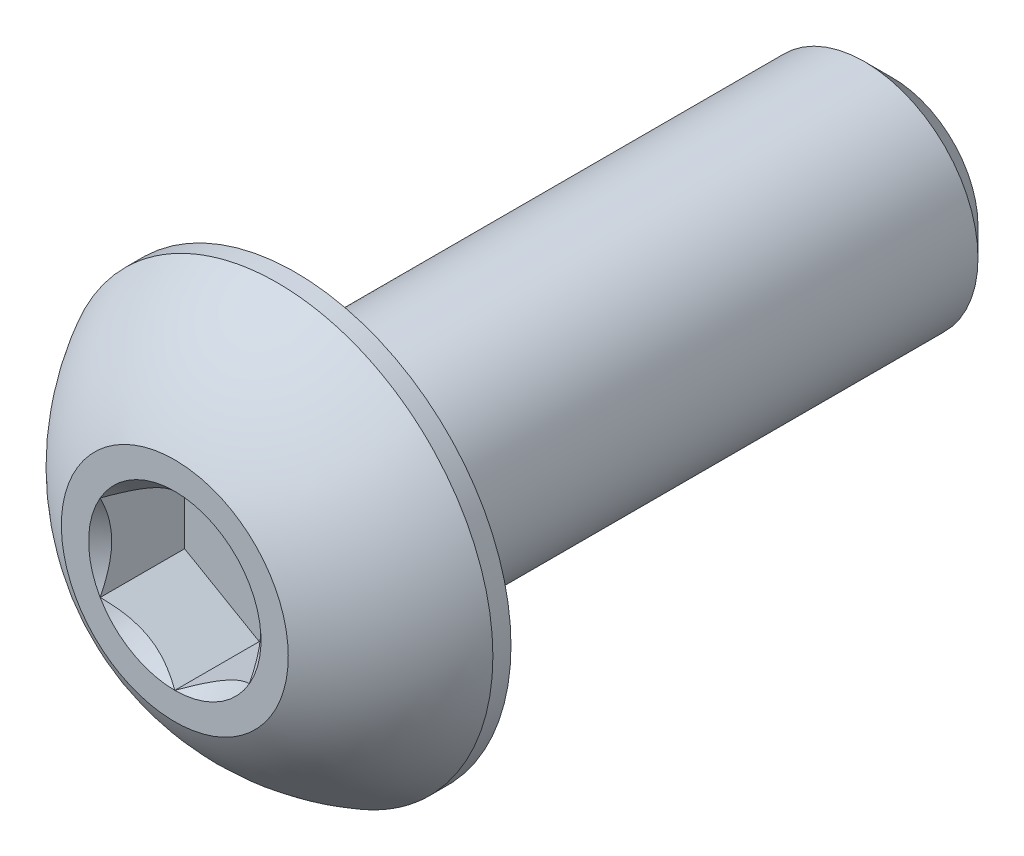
ISO-10303-21;
HEADER;
FILE_DESCRIPTION(('STEP AP214'),'2;1');
FILE_NAME('part.step','',(''),(''),'','','');
FILE_SCHEMA(('AUTOMOTIVE_DESIGN { 1 0 10303 214 1 1 1 1 }'));
ENDSEC;
DATA;
#1=APPLICATION_CONTEXT('core data for automotive mechanical design processes');
#2=APPLICATION_PROTOCOL_DEFINITION('international standard','automotive_design',2000,#1);
#3=PRODUCT_CONTEXT('',#1,'mechanical');
#4=PRODUCT('Part','Part','',(#3));
#5=PRODUCT_RELATED_PRODUCT_CATEGORY('part','',(#4));
#6=PRODUCT_DEFINITION_FORMATION('','',#4);
#7=PRODUCT_DEFINITION_CONTEXT('part definition',#1,'design');
#8=PRODUCT_DEFINITION('design','',#6,#7);
#9=PRODUCT_DEFINITION_SHAPE('','',#8);
#10=(LENGTH_UNIT() NAMED_UNIT(*) SI_UNIT(.MILLI.,.METRE.));
#11=(NAMED_UNIT(*) PLANE_ANGLE_UNIT() SI_UNIT($,.RADIAN.));
#12=(NAMED_UNIT(*) SI_UNIT($,.STERADIAN.) SOLID_ANGLE_UNIT());
#13=UNCERTAINTY_MEASURE_WITH_UNIT(LENGTH_MEASURE(1.E-05),#10,'distance_accuracy_value','');
#14=(GEOMETRIC_REPRESENTATION_CONTEXT(3) GLOBAL_UNCERTAINTY_ASSIGNED_CONTEXT((#13)) GLOBAL_UNIT_ASSIGNED_CONTEXT((#10,
#11,#12)) REPRESENTATION_CONTEXT('',''));
#15=CARTESIAN_POINT('',(0.,0.,0.));
#16=DIRECTION('',(0.,0.,1.));
#17=DIRECTION('',(1.,0.,0.));
#18=AXIS2_PLACEMENT_3D('',#15,#16,#17);
#19=CARTESIAN_POINT('',(1.5875,-0.91654355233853,-1.79578));
#20=DIRECTION('',(1.,0.,0.));
#21=DIRECTION('',(0.,0.,-1.));
#22=AXIS2_PLACEMENT_3D('',#19,#20,#21);
#23=PLANE('',#22);
#24=CARTESIAN_POINT('',(1.5875,0.916543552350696,-4.5148160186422E-11));
#25=CARTESIAN_POINT('',(1.5875,0.853951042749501,-0.0312670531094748));
#26=CARTESIAN_POINT('',(1.5875,0.790318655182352,-0.0607084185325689));
#27=CARTESIAN_POINT('',(1.5875,0.660541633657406,-0.114675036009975));
#28=CARTESIAN_POINT('',(1.5875,0.594383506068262,-0.139167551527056));
#29=CARTESIAN_POINT('',(1.5875,0.460155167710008,-0.181460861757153));
#30=CARTESIAN_POINT('',(1.5875,0.392092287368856,-0.199284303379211));
#31=CARTESIAN_POINT('',(1.5875,0.25447447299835,-0.226724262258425));
#32=CARTESIAN_POINT('',(1.5875,0.184924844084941,-0.23636615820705));
#33=CARTESIAN_POINT('',(1.5875,0.0959348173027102,-0.242807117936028));
#34=CARTESIAN_POINT('',(1.5875,0.0767574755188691,-0.243848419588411));
#35=CARTESIAN_POINT('',(1.5875,0.0383876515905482,-0.245238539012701));
#36=CARTESIAN_POINT('',(1.5875,0.0191951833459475,-0.245587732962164));
#37=CARTESIAN_POINT('',(1.5875,-0.04817613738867,-0.245585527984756));
#38=CARTESIAN_POINT('',(1.5875,-0.0963693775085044,-0.243380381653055));
#39=CARTESIAN_POINT('',(1.5875,-0.19237997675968,-0.234690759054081));
#40=CARTESIAN_POINT('',(1.5875,-0.240197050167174,-0.22820329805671));
#41=CARTESIAN_POINT('',(1.5875,-0.383011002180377,-0.202723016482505));
#42=CARTESIAN_POINT('',(1.5875,-0.476967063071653,-0.177716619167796));
#43=CARTESIAN_POINT('',(1.5875,-0.628737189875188,-0.12655997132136));
#44=CARTESIAN_POINT('',(1.5875,-0.687787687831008,-0.103812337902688));
#45=CARTESIAN_POINT('',(1.5875,-0.80365276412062,-0.0545108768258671));
#46=CARTESIAN_POINT('',(1.5875,-0.860482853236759,-0.0279937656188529));
#47=CARTESIAN_POINT('',(1.5875,-0.916543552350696,-4.51483131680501E-11));
#48=B_SPLINE_CURVE_WITH_KNOTS('',3,(#24,#25,#26,#27,#28,#29,#30,#31,#32,#33,#34,#35,#36,#37,#38,
#39,#40,#41,#42,#43,#44,#45,#46,#47),.UNSPECIFIED.,.F.,.F.,(4,2,2,2,2,2,2,2,2,2,2,4),(0.,
0.210047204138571,0.421441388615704,0.632111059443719,0.842124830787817,0.899732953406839,
0.957309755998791,1.10181621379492,1.246423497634,1.53683268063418,1.72655304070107,
1.91453812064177),.UNSPECIFIED.);
#49=CARTESIAN_POINT('',(1.58750000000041,0.916543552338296,-5.09958482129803E-11));
#50=VERTEX_POINT('',#49);
#51=CARTESIAN_POINT('',(1.58750000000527,-0.916543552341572,-4.51486722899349E-11));
#52=VERTEX_POINT('',#51);
#53=EDGE_CURVE('E20',#50,#52,#48,.T.);
#54=ORIENTED_EDGE('',*,*,#53,.F.);
#55=DIRECTION('',(0.,0.,1.));
#56=VECTOR('',#55,1.);
#57=CARTESIAN_POINT('',(1.5875,0.916543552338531,-1.79578));
#58=LINE('',#57,#56);
#59=CARTESIAN_POINT('',(1.5875,0.916543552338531,-1.79578));
#60=VERTEX_POINT('',#59);
#61=EDGE_CURVE('E68',#50,#60,#58,.F.);
#62=ORIENTED_EDGE('',*,*,#61,.T.);
#63=DIRECTION('',(0.,1.,0.));
#64=VECTOR('',#63,1.);
#65=CARTESIAN_POINT('',(1.5875,-0.91654355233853,-1.79578));
#66=LINE('',#65,#64);
#67=CARTESIAN_POINT('',(1.5875,-0.91654355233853,-1.79578));
#68=VERTEX_POINT('',#67);
#69=EDGE_CURVE('E74',#68,#60,#66,.T.);
#70=ORIENTED_EDGE('',*,*,#69,.F.);
#71=DIRECTION('',(0.,0.,1.));
#72=VECTOR('',#71,1.);
#73=CARTESIAN_POINT('',(1.5875,-0.91654355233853,-1.79578));
#74=LINE('',#73,#72);
#75=EDGE_CURVE('E71',#68,#52,#74,.T.);
#76=ORIENTED_EDGE('',*,*,#75,.T.);
#77=EDGE_LOOP('',(#54,#62,#70,#76));
#78=FACE_BOUND('',#77,.T.);
#79=ADVANCED_FACE('F16',(#78),#23,.F.);
#80=CARTESIAN_POINT('',(1.5875,-0.91654355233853,-1.79578));
#81=DIRECTION('',(0.,0.,1.));
#82=DIRECTION('',(1.,0.,0.));
#83=AXIS2_PLACEMENT_3D('',#80,#81,#82);
#84=PLANE('',#83);
#85=DIRECTION('',(0.,-1.,0.));
#86=VECTOR('',#85,1.);
#87=CARTESIAN_POINT('',(-1.5875,0.916543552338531,-1.79578));
#88=LINE('',#87,#86);
#89=CARTESIAN_POINT('',(-1.5875,0.91654355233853,-1.79578));
#90=VERTEX_POINT('',#89);
#91=CARTESIAN_POINT('',(-1.5875,-0.916543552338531,-1.79578));
#92=VERTEX_POINT('',#91);
#93=EDGE_CURVE('E217',#90,#92,#88,.T.);
#94=ORIENTED_EDGE('',*,*,#93,.T.);
#95=DIRECTION('',(0.866025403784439,-0.5,0.));
#96=VECTOR('',#95,1.);
#97=CARTESIAN_POINT('',(-1.5875,-0.916543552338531,-1.79578));
#98=LINE('',#97,#96);
#99=CARTESIAN_POINT('',(0.,-1.83308710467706,-1.79578));
#100=VERTEX_POINT('',#99);
#101=EDGE_CURVE('E243',#92,#100,#98,.T.);
#102=ORIENTED_EDGE('',*,*,#101,.T.);
#103=DIRECTION('',(0.866025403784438,0.5,0.));
#104=VECTOR('',#103,1.);
#105=CARTESIAN_POINT('',(0.,-1.83308710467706,-1.79578));
#106=LINE('',#105,#104);
#107=EDGE_CURVE('E232',#100,#68,#106,.T.);
#108=ORIENTED_EDGE('',*,*,#107,.T.);
#109=ORIENTED_EDGE('',*,*,#69,.T.);
#110=DIRECTION('',(-0.866025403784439,0.5,0.));
#111=VECTOR('',#110,1.);
#112=CARTESIAN_POINT('',(1.5875,0.916543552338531,-1.79578));
#113=LINE('',#112,#111);
#114=CARTESIAN_POINT('',(0.,1.83308710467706,-1.79578));
#115=VERTEX_POINT('',#114);
#116=EDGE_CURVE('E81',#60,#115,#113,.T.);
#117=ORIENTED_EDGE('',*,*,#116,.T.);
#118=DIRECTION('',(-0.866025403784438,-0.5,0.));
#119=VECTOR('',#118,1.);
#120=CARTESIAN_POINT('',(0.,1.83308710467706,-1.79578));
#121=LINE('',#120,#119);
#122=EDGE_CURVE('E82',#115,#90,#121,.T.);
#123=ORIENTED_EDGE('',*,*,#122,.T.);
#124=EDGE_LOOP('',(#94,#102,#108,#109,#117,#123));
#125=FACE_BOUND('',#124,.T.);
#126=ADVANCED_FACE('F161',(#125),#84,.T.);
#127=CARTESIAN_POINT('',(-1.5875,-0.916543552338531,-1.79578));
#128=DIRECTION('',(-0.5,-0.866025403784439,0.));
#129=DIRECTION('',(0.866025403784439,-0.5,0.));
#130=AXIS2_PLACEMENT_3D('',#127,#128,#129);
#131=PLANE('',#130);
#132=CARTESIAN_POINT('',(-1.58750000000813,-0.916543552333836,-4.65365177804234E-11));
#133=CARTESIAN_POINT('',(-1.53293684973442,-0.948045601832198,-0.0314718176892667));
#134=CARTESIAN_POINT('',(-1.47746140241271,-0.980074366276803,-0.0610949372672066));
#135=CARTESIAN_POINT('',(-1.36434127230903,-1.04538430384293,-0.115333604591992));
#136=CARTESIAN_POINT('',(-1.30668583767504,-1.07867168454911,-0.139918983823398));
#137=CARTESIAN_POINT('',(-1.1904264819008,-1.14579405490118,-0.18203390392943));
#138=CARTESIAN_POINT('',(-1.13185215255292,-1.17961195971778,-0.199669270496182));
#139=CARTESIAN_POINT('',(-1.01341433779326,-1.2479920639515,-0.226839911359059));
#140=CARTESIAN_POINT('',(-0.95355446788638,-1.28255217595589,-0.236395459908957));
#141=CARTESIAN_POINT('',(-0.850383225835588,-1.34211812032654,-0.245017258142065));
#142=CARTESIAN_POINT('',(-0.807205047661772,-1.36704705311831,-0.24629317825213));
#143=CARTESIAN_POINT('',(-0.720919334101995,-1.41686413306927,-0.244140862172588));
#144=CARTESIAN_POINT('',(-0.677811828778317,-1.44175226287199,-0.240710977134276));
#145=CARTESIAN_POINT('',(-0.592014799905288,-1.4912872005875,-0.22934368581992));
#146=CARTESIAN_POINT('',(-0.54932567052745,-1.51593378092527,-0.2214023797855));
#147=CARTESIAN_POINT('',(-0.464663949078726,-1.56481324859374,-0.2014437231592));
#148=CARTESIAN_POINT('',(-0.422691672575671,-1.58904595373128,-0.189424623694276));
#149=CARTESIAN_POINT('',(-0.315224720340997,-1.65109202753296,-0.153756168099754));
#150=CARTESIAN_POINT('',(-0.25039544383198,-1.68852122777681,-0.127422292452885));
#151=CARTESIAN_POINT('',(-0.155071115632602,-1.74355675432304,-0.0829693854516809));
#152=CARTESIAN_POINT('',(-0.12365879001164,-1.76169266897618,-0.0673516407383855));
#153=CARTESIAN_POINT('',(-0.0614115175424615,-1.79763114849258,-0.0346905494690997));
#154=CARTESIAN_POINT('',(-0.0305763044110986,-1.81543386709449,-0.0176478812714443));
#155=CARTESIAN_POINT('',(8.13171000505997E-12,-1.83308710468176,-4.65365727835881E-11));
#156=B_SPLINE_CURVE_WITH_KNOTS('',3,(#132,#133,#134,#135,#136,#137,#138,#139,#140,#141,#142,
#143,#144,#145,#146,#147,#148,#149,#150,#151,#152,#153,#154,#155),.UNSPECIFIED.,.F.,.F.,(4,2,2,
2,2,2,2,2,2,2,2,4),(0.,0.211427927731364,0.424087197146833,0.633370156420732,0.842126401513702,
0.991537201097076,1.14100036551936,1.29059292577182,1.44024972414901,1.67781721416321,
1.79627069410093,1.91466809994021),.UNSPECIFIED.);
#157=CARTESIAN_POINT('',(-1.58750000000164,-0.91654355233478,-5.16899840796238E-11));
#158=VERTEX_POINT('',#157);
#159=CARTESIAN_POINT('',(7.95488278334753E-13,-1.8330871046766,-5.1689793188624E-11));
#160=VERTEX_POINT('',#159);
#161=EDGE_CURVE('E163',#158,#160,#156,.T.);
#162=ORIENTED_EDGE('',*,*,#161,.T.);
#163=DIRECTION('',(0.,0.,1.));
#164=VECTOR('',#163,1.);
#165=CARTESIAN_POINT('',(0.,-1.83308710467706,-1.79578));
#166=LINE('',#165,#164);
#167=EDGE_CURVE('E226',#160,#100,#166,.F.);
#168=ORIENTED_EDGE('',*,*,#167,.T.);
#169=ORIENTED_EDGE('',*,*,#101,.F.);
#170=DIRECTION('',(0.,0.,1.));
#171=VECTOR('',#170,1.);
#172=CARTESIAN_POINT('',(-1.5875,-0.916543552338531,-1.79578));
#173=LINE('',#172,#171);
#174=EDGE_CURVE('E213',#92,#158,#173,.T.);
#175=ORIENTED_EDGE('',*,*,#174,.T.);
#176=EDGE_LOOP('',(#162,#168,#169,#175));
#177=FACE_BOUND('',#176,.T.);
#178=ADVANCED_FACE('F157',(#177),#131,.F.);
#179=CARTESIAN_POINT('',(0.,-1.83308710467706,-1.79578));
#180=DIRECTION('',(0.5,-0.866025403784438,0.));
#181=DIRECTION('',(0.866025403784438,0.5,0.));
#182=AXIS2_PLACEMENT_3D('',#179,#180,#181);
#183=PLANE('',#182);
#184=CARTESIAN_POINT('',(-8.13084748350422E-12,-1.83308710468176,-4.65361675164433E-11));
#185=CARTESIAN_POINT('',(0.0545631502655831,-1.80158505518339,-0.0314718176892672));
#186=CARTESIAN_POINT('',(0.110038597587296,-1.76955629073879,-0.0610949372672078));
#187=CARTESIAN_POINT('',(0.22315872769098,-1.70424635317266,-0.115333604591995));
#188=CARTESIAN_POINT('',(0.280814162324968,-1.67095897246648,-0.1399189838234));
#189=CARTESIAN_POINT('',(0.397073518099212,-1.60383660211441,-0.182033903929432));
#190=CARTESIAN_POINT('',(0.455647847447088,-1.57001869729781,-0.199669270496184));
#191=CARTESIAN_POINT('',(0.574085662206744,-1.50163859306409,-0.226839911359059));
#192=CARTESIAN_POINT('',(0.633945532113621,-1.4670784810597,-0.236395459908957));
#193=CARTESIAN_POINT('',(0.737116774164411,-1.40751253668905,-0.245017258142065));
#194=CARTESIAN_POINT('',(0.780294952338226,-1.38258360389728,-0.24629317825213));
#195=CARTESIAN_POINT('',(0.866580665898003,-1.33276652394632,-0.244140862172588));
#196=CARTESIAN_POINT('',(0.90968817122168,-1.30787839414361,-0.240710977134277));
#197=CARTESIAN_POINT('',(0.995485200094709,-1.25834345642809,-0.229343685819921));
#198=CARTESIAN_POINT('',(1.03817432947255,-1.23369687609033,-0.2214023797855));
#199=CARTESIAN_POINT('',(1.12283605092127,-1.18481740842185,-0.2014437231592));
#200=CARTESIAN_POINT('',(1.16480832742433,-1.16058470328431,-0.189424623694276));
#201=CARTESIAN_POINT('',(1.27227527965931,-1.09853862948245,-0.153756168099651));
#202=CARTESIAN_POINT('',(1.33710455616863,-1.06110942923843,-0.127422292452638));
#203=CARTESIAN_POINT('',(1.43242888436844,-1.00607390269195,-0.0829693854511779));
#204=CARTESIAN_POINT('',(1.46384120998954,-0.987937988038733,-0.0673516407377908));
#205=CARTESIAN_POINT('',(1.52608848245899,-0.951999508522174,-0.0346905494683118));
#206=CARTESIAN_POINT('',(1.55692369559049,-0.934196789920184,-0.0176478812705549));
#207=CARTESIAN_POINT('',(1.58750000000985,-0.916543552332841,-4.55419445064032E-11));
#208=B_SPLINE_CURVE_WITH_KNOTS('',3,(#184,#185,#186,#187,#188,#189,#190,#191,#192,#193,#194,
#195,#196,#197,#198,#199,#200,#201,#202,#203,#204,#205,#206,#207),.UNSPECIFIED.,.F.,.F.,(4,2,2,
2,2,2,2,2,2,2,2,4),(0.,0.211427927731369,0.424087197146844,0.633370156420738,0.842126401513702,
0.991537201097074,1.14100036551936,1.29059292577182,1.44024972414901,1.67781721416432,
1.7962706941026,1.91466809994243),.UNSPECIFIED.);
#209=EDGE_CURVE('E91',#160,#52,#208,.T.);
#210=ORIENTED_EDGE('',*,*,#209,.T.);
#211=ORIENTED_EDGE('',*,*,#75,.F.);
#212=ORIENTED_EDGE('',*,*,#107,.F.);
#213=ORIENTED_EDGE('',*,*,#167,.F.);
#214=EDGE_LOOP('',(#210,#211,#212,#213));
#215=FACE_BOUND('',#214,.T.);
#216=ADVANCED_FACE('F152',(#215),#183,.F.);
#217=CARTESIAN_POINT('',(1.5875,0.916543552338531,-1.79578));
#218=DIRECTION('',(0.5,0.866025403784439,0.));
#219=DIRECTION('',(-0.866025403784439,0.5,0.));
#220=AXIS2_PLACEMENT_3D('',#217,#218,#219);
#221=PLANE('',#220);
#222=CARTESIAN_POINT('',(1.58750000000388,0.916543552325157,-4.09205335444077E-11));
#223=CARTESIAN_POINT('',(1.53293684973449,0.948045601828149,-0.0314718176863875));
#224=CARTESIAN_POINT('',(1.47746140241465,0.980074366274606,-0.0610949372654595));
#225=CARTESIAN_POINT('',(1.3643412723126,1.04538430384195,-0.1153336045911));
#226=CARTESIAN_POINT('',(1.30668583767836,1.07867168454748,-0.139918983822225));
#227=CARTESIAN_POINT('',(1.19042648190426,1.1457940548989,-0.182033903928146));
#228=CARTESIAN_POINT('',(1.13185215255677,1.17961195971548,-0.199669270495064));
#229=CARTESIAN_POINT('',(1.01341433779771,1.247992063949,-0.226839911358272));
#230=CARTESIAN_POINT('',(0.953554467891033,1.28255217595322,-0.236395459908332));
#231=CARTESIAN_POINT('',(0.85038322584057,1.34211812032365,-0.245017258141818));
#232=CARTESIAN_POINT('',(0.807205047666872,1.36704705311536,-0.246293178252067));
#233=CARTESIAN_POINT('',(0.720919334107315,1.4168641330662,-0.24414086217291));
#234=CARTESIAN_POINT('',(0.677811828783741,1.44175226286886,-0.240710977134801));
#235=CARTESIAN_POINT('',(0.592014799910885,1.49128720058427,-0.229343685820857));
#236=CARTESIAN_POINT('',(0.549325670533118,1.51593378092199,-0.221402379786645));
#237=CARTESIAN_POINT('',(0.464663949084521,1.5648132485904,-0.201443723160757));
#238=CARTESIAN_POINT('',(0.422691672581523,1.58904595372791,-0.189424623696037));
#239=CARTESIAN_POINT('',(0.315224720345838,1.65109202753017,-0.153756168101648));
#240=CARTESIAN_POINT('',(0.250395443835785,1.68852122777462,-0.127422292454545));
#241=CARTESIAN_POINT('',(0.155071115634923,1.7435567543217,-0.0829693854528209));
#242=CARTESIAN_POINT('',(0.123658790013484,1.76169266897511,-0.0673516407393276));
#243=CARTESIAN_POINT('',(0.0614115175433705,1.79763114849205,-0.0346905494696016));
#244=CARTESIAN_POINT('',(0.0305763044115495,1.81543386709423,-0.0176478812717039));
#245=CARTESIAN_POINT('',(-8.13179444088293E-12,1.83308710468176,-4.65362862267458E-11));
#246=B_SPLINE_CURVE_WITH_KNOTS('',3,(#222,#223,#224,#225,#226,#227,#228,#229,#230,#231,#232,
#233,#234,#235,#236,#237,#238,#239,#240,#241,#242,#243,#244,#245),.UNSPECIFIED.,.F.,.F.,(4,2,2,
2,2,2,2,2,2,2,2,4),(0.,0.211427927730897,0.424087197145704,0.633370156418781,0.842126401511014,
0.991537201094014,1.1410003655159,1.29059292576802,1.44024972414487,1.67781721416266,
1.79627069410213,1.91466809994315),.UNSPECIFIED.);
#247=CARTESIAN_POINT('',(-7.95207176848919E-13,1.8330871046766,-5.16898686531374E-11));
#248=VERTEX_POINT('',#247);
#249=EDGE_CURVE('E79',#50,#248,#246,.T.);
#250=ORIENTED_EDGE('',*,*,#249,.T.);
#251=DIRECTION('',(0.,0.,1.));
#252=VECTOR('',#251,1.);
#253=CARTESIAN_POINT('',(0.,1.83308710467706,-1.79578));
#254=LINE('',#253,#252);
#255=EDGE_CURVE('E220',#248,#115,#254,.F.);
#256=ORIENTED_EDGE('',*,*,#255,.T.);
#257=ORIENTED_EDGE('',*,*,#116,.F.);
#258=ORIENTED_EDGE('',*,*,#61,.F.);
#259=EDGE_LOOP('',(#250,#256,#257,#258));
#260=FACE_BOUND('',#259,.T.);
#261=ADVANCED_FACE('F76',(#260),#221,.F.);
#262=CARTESIAN_POINT('',(0.,1.83308710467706,-1.79578));
#263=DIRECTION('',(-0.5,0.866025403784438,0.));
#264=DIRECTION('',(-0.866025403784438,-0.5,0.));
#265=AXIS2_PLACEMENT_3D('',#262,#263,#264);
#266=PLANE('',#265);
#267=CARTESIAN_POINT('',(8.13097600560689E-12,1.83308710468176,-4.65363184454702E-11));
#268=CARTESIAN_POINT('',(-0.0545631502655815,1.80158505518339,-0.0314718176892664));
#269=CARTESIAN_POINT('',(-0.110038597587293,1.76955629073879,-0.0610949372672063));
#270=CARTESIAN_POINT('',(-0.223158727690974,1.70424635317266,-0.115333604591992));
#271=CARTESIAN_POINT('',(-0.280814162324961,1.67095897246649,-0.139918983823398));
#272=CARTESIAN_POINT('',(-0.397073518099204,1.60383660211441,-0.18203390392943));
#273=CARTESIAN_POINT('',(-0.455647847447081,1.57001869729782,-0.199669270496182));
#274=CARTESIAN_POINT('',(-0.574085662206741,1.50163859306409,-0.226839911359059));
#275=CARTESIAN_POINT('',(-0.63394553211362,1.4670784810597,-0.236395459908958));
#276=CARTESIAN_POINT('',(-0.737116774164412,1.40751253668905,-0.245017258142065));
#277=CARTESIAN_POINT('',(-0.780294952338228,1.38258360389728,-0.24629317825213));
#278=CARTESIAN_POINT('',(-0.866580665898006,1.33276652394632,-0.244140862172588));
#279=CARTESIAN_POINT('',(-0.909688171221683,1.3078783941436,-0.240710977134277));
#280=CARTESIAN_POINT('',(-0.995485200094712,1.25834345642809,-0.22934368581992));
#281=CARTESIAN_POINT('',(-1.03817432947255,1.23369687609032,-0.2214023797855));
#282=CARTESIAN_POINT('',(-1.12283605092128,1.18481740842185,-0.2014437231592));
#283=CARTESIAN_POINT('',(-1.16480832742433,1.16058470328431,-0.189424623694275));
#284=CARTESIAN_POINT('',(-1.272275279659,1.09853862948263,-0.153756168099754));
#285=CARTESIAN_POINT('',(-1.33710455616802,1.06110942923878,-0.127422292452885));
#286=CARTESIAN_POINT('',(-1.4324288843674,1.00607390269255,-0.082969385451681));
#287=CARTESIAN_POINT('',(-1.46384120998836,0.987937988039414,-0.0673516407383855));
#288=CARTESIAN_POINT('',(-1.52608848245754,0.951999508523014,-0.0346905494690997));
#289=CARTESIAN_POINT('',(-1.5569236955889,0.934196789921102,-0.0176478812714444));
#290=CARTESIAN_POINT('',(-1.58750000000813,0.916543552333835,-4.65368165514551E-11));
#291=B_SPLINE_CURVE_WITH_KNOTS('',3,(#267,#268,#269,#270,#271,#272,#273,#274,#275,#276,#277,
#278,#279,#280,#281,#282,#283,#284,#285,#286,#287,#288,#289,#290),.UNSPECIFIED.,.F.,.F.,(4,2,2,
2,2,2,2,2,2,2,2,4),(0.,0.211427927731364,0.424087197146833,0.633370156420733,0.842126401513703,
0.991537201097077,1.14100036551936,1.29059292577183,1.44024972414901,1.67781721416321,
1.79627069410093,1.91466809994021),.UNSPECIFIED.);
#292=CARTESIAN_POINT('',(-1.5875,0.916543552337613,-5.16898734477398E-11));
#293=VERTEX_POINT('',#292);
#294=EDGE_CURVE('E39',#248,#293,#291,.T.);
#295=ORIENTED_EDGE('',*,*,#294,.T.);
#296=DIRECTION('',(0.,0.,1.));
#297=VECTOR('',#296,1.);
#298=CARTESIAN_POINT('',(-1.5875,0.916543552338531,-1.79578));
#299=LINE('',#298,#297);
#300=EDGE_CURVE('E167',#293,#90,#299,.F.);
#301=ORIENTED_EDGE('',*,*,#300,.T.);
#302=ORIENTED_EDGE('',*,*,#122,.F.);
#303=ORIENTED_EDGE('',*,*,#255,.F.);
#304=EDGE_LOOP('',(#295,#301,#302,#303));
#305=FACE_BOUND('',#304,.T.);
#306=ADVANCED_FACE('F151',(#305),#266,.F.);
#307=CARTESIAN_POINT('',(-1.5875,0.916543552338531,-1.79578));
#308=DIRECTION('',(-1.,0.,0.));
#309=DIRECTION('',(0.,-1.,0.));
#310=AXIS2_PLACEMENT_3D('',#307,#308,#309);
#311=PLANE('',#310);
#312=CARTESIAN_POINT('',(-1.5875,0.91654355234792,-4.65364617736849E-11));
#313=CARTESIAN_POINT('',(-1.5875,0.853539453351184,-0.0314718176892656));
#314=CARTESIAN_POINT('',(-1.5875,0.789481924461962,-0.0610949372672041));
#315=CARTESIAN_POINT('',(-1.5875,0.658862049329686,-0.115333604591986));
#316=CARTESIAN_POINT('',(-1.5875,0.59228728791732,-0.139918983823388));
#317=CARTESIAN_POINT('',(-1.5875,0.458042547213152,-0.182033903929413));
#318=CARTESIAN_POINT('',(-1.5875,0.390406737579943,-0.199669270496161));
#319=CARTESIAN_POINT('',(-1.5875,0.25364652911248,-0.226839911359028));
#320=CARTESIAN_POINT('',(-1.5875,0.184526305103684,-0.23639545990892));
#321=CARTESIAN_POINT('',(-1.5875,0.0653944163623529,-0.245017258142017));
#322=CARTESIAN_POINT('',(-1.5875,0.0155365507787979,-0.246293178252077));
#323=CARTESIAN_POINT('',(-1.5875,-0.0840976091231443,-0.244140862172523));
#324=CARTESIAN_POINT('',(-1.5875,-0.133873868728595,-0.240710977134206));
#325=CARTESIAN_POINT('',(-1.5875,-0.23294374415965,-0.229343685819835));
#326=CARTESIAN_POINT('',(-1.5875,-0.282236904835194,-0.221402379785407));
#327=CARTESIAN_POINT('',(-1.5875,-0.379995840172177,-0.20144372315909));
#328=CARTESIAN_POINT('',(-1.5875,-0.42846125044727,-0.189424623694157));
#329=CARTESIAN_POINT('',(-1.5875,-0.552553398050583,-0.153756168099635));
#330=CARTESIAN_POINT('',(-1.5875,-0.627411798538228,-0.127422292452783));
#331=CARTESIAN_POINT('',(-1.5875,-0.737482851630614,-0.0829693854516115));
#332=CARTESIAN_POINT('',(-1.5875,-0.773754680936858,-0.0673516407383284));
#333=CARTESIAN_POINT('',(-1.5875,-0.84563163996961,-0.0346905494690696));
#334=CARTESIAN_POINT('',(-1.5875,-0.88123707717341,-0.0176478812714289));
#335=CARTESIAN_POINT('',(-1.5875,-0.91654355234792,-4.65367892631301E-11));
#336=B_SPLINE_CURVE_WITH_KNOTS('',3,(#312,#313,#314,#315,#316,#317,#318,#319,#320,#321,#322,
#323,#324,#325,#326,#327,#328,#329,#330,#331,#332,#333,#334,#335),.UNSPECIFIED.,.F.,.F.,(4,2,2,
2,2,2,2,2,2,2,2,4),(0.,0.211427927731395,0.424087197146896,0.633370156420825,0.842126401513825,
0.991537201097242,1.14100036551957,1.29059292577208,1.44024972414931,1.67781721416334,
1.79627069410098,1.91466809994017),.UNSPECIFIED.);
#337=EDGE_CURVE('E108',#293,#158,#336,.T.);
#338=ORIENTED_EDGE('',*,*,#337,.T.);
#339=ORIENTED_EDGE('',*,*,#174,.F.);
#340=ORIENTED_EDGE('',*,*,#93,.F.);
#341=ORIENTED_EDGE('',*,*,#300,.F.);
#342=EDGE_LOOP('',(#338,#339,#340,#341));
#343=FACE_BOUND('',#342,.T.);
#344=ADVANCED_FACE('F121',(#343),#311,.F.);
#345=CARTESIAN_POINT('',(0.,0.,-5.6843418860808E-11));
#346=DIRECTION('',(0.,0.,1.));
#347=DIRECTION('',(1.,0.,0.));
#348=AXIS2_PLACEMENT_3D('',#345,#346,#347);
#349=CONICAL_SURFACE('',#348,1.83308710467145,0.78539816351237);
#350=ORIENTED_EDGE('',*,*,#161,.F.);
#351=CARTESIAN_POINT('',(0.,0.,-5.6843418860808E-11));
#352=DIRECTION('',(0.,0.,1.));
#353=DIRECTION('',(1.,0.,0.));
#354=AXIS2_PLACEMENT_3D('',#351,#352,#353);
#355=CIRCLE('',#354,1.83308710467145);
#356=EDGE_CURVE('E105',#158,#160,#355,.T.);
#357=ORIENTED_EDGE('',*,*,#356,.T.);
#358=EDGE_LOOP('',(#350,#357));
#359=FACE_BOUND('',#358,.T.);
#360=ADVANCED_FACE('F168',(#359),#349,.F.);
#361=CARTESIAN_POINT('',(0.,0.,-5.6843418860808E-11));
#362=DIRECTION('',(0.,0.,1.));
#363=DIRECTION('',(1.,0.,0.));
#364=AXIS2_PLACEMENT_3D('',#361,#362,#363);
#365=CONICAL_SURFACE('',#364,1.83308710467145,0.78539816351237);
#366=ORIENTED_EDGE('',*,*,#209,.F.);
#367=CARTESIAN_POINT('',(0.,0.,-5.6843418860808E-11));
#368=DIRECTION('',(0.,0.,1.));
#369=DIRECTION('',(1.,0.,0.));
#370=AXIS2_PLACEMENT_3D('',#367,#368,#369);
#371=CIRCLE('',#370,1.83308710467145);
#372=EDGE_CURVE('E86',#160,#52,#371,.T.);
#373=ORIENTED_EDGE('',*,*,#372,.T.);
#374=EDGE_LOOP('',(#366,#373));
#375=FACE_BOUND('',#374,.T.);
#376=ADVANCED_FACE('F171',(#375),#365,.F.);
#377=CARTESIAN_POINT('',(0.,0.,-5.6843418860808E-11));
#378=DIRECTION('',(0.,0.,1.));
#379=DIRECTION('',(1.,0.,0.));
#380=AXIS2_PLACEMENT_3D('',#377,#378,#379);
#381=CONICAL_SURFACE('',#380,1.83308710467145,0.785398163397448);
#382=CARTESIAN_POINT('',(0.,0.,-5.6843418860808E-11));
#383=DIRECTION('',(0.,0.,1.));
#384=DIRECTION('',(1.,0.,0.));
#385=AXIS2_PLACEMENT_3D('',#382,#383,#384);
#386=CIRCLE('',#385,1.83308710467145);
#387=EDGE_CURVE('E59',#52,#50,#386,.T.);
#388=ORIENTED_EDGE('',*,*,#387,.T.);
#389=ORIENTED_EDGE('',*,*,#53,.T.);
#390=EDGE_LOOP('',(#388,#389));
#391=FACE_BOUND('',#390,.T.);
#392=ADVANCED_FACE('F84',(#391),#381,.F.);
#393=CARTESIAN_POINT('',(0.,0.,-5.6843418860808E-11));
#394=DIRECTION('',(0.,0.,1.));
#395=DIRECTION('',(1.,0.,0.));
#396=AXIS2_PLACEMENT_3D('',#393,#394,#395);
#397=CONICAL_SURFACE('',#396,1.83308710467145,0.78539816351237);
#398=ORIENTED_EDGE('',*,*,#249,.F.);
#399=CARTESIAN_POINT('',(0.,0.,-5.6843418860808E-11));
#400=DIRECTION('',(0.,0.,1.));
#401=DIRECTION('',(1.,0.,0.));
#402=AXIS2_PLACEMENT_3D('',#399,#400,#401);
#403=CIRCLE('',#402,1.83308710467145);
#404=EDGE_CURVE('E85',#50,#248,#403,.T.);
#405=ORIENTED_EDGE('',*,*,#404,.T.);
#406=EDGE_LOOP('',(#398,#405));
#407=FACE_BOUND('',#406,.T.);
#408=ADVANCED_FACE('F90',(#407),#397,.F.);
#409=CARTESIAN_POINT('',(0.,0.,-5.6843418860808E-11));
#410=DIRECTION('',(0.,0.,1.));
#411=DIRECTION('',(1.,0.,0.));
#412=AXIS2_PLACEMENT_3D('',#409,#410,#411);
#413=CONICAL_SURFACE('',#412,1.83308710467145,0.78539816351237);
#414=ORIENTED_EDGE('',*,*,#294,.F.);
#415=CARTESIAN_POINT('',(0.,0.,-5.68432020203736E-11));
#416=DIRECTION('',(0.,0.,1.));
#417=DIRECTION('',(1.,0.,0.));
#418=AXIS2_PLACEMENT_3D('',#415,#416,#417);
#419=CIRCLE('',#418,1.83308710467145);
#420=EDGE_CURVE('E97',#248,#293,#419,.T.);
#421=ORIENTED_EDGE('',*,*,#420,.T.);
#422=EDGE_LOOP('',(#414,#421));
#423=FACE_BOUND('',#422,.T.);
#424=ADVANCED_FACE('F128',(#423),#413,.F.);
#425=CARTESIAN_POINT('',(0.,0.,-5.6843418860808E-11));
#426=DIRECTION('',(0.,0.,1.));
#427=DIRECTION('',(1.,0.,0.));
#428=AXIS2_PLACEMENT_3D('',#425,#426,#427);
#429=CONICAL_SURFACE('',#428,1.83308710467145,0.785398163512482);
#430=ORIENTED_EDGE('',*,*,#337,.F.);
#431=CARTESIAN_POINT('',(0.,0.,-5.6843418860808E-11));
#432=DIRECTION('',(0.,0.,1.));
#433=DIRECTION('',(1.,0.,0.));
#434=AXIS2_PLACEMENT_3D('',#431,#432,#433);
#435=CIRCLE('',#434,1.83308710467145);
#436=EDGE_CURVE('E99',#293,#158,#435,.T.);
#437=ORIENTED_EDGE('',*,*,#436,.T.);
#438=EDGE_LOOP('',(#430,#437));
#439=FACE_BOUND('',#438,.T.);
#440=ADVANCED_FACE('F124',(#439),#429,.F.);
#441=CARTESIAN_POINT('',(0.,-2.413,0.));
#442=DIRECTION('',(0.,0.,-1.));
#443=DIRECTION('',(-1.,0.,0.));
#444=AXIS2_PLACEMENT_3D('',#441,#442,#443);
#445=PLANE('',#444);
#446=CARTESIAN_POINT('',(0.,2.41300000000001,0.));
#447=CARTESIAN_POINT('',(0.0677494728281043,2.41299959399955,0.));
#448=CARTESIAN_POINT('',(0.13551139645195,2.41014415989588,0.));
#449=CARTESIAN_POINT('',(0.270566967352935,2.39874098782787,0.));
#450=CARTESIAN_POINT('',(0.337860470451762,2.39019156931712,-1.27847024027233E-13));
#451=CARTESIAN_POINT('',(0.471601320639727,2.36743889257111,1.28918507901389E-13));
#452=CARTESIAN_POINT('',(0.538047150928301,2.35322665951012,4.80959012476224E-13));
#453=CARTESIAN_POINT('',(0.669542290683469,2.31924632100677,-4.80482413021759E-13));
#454=CARTESIAN_POINT('',(0.734590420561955,2.29947370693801,-1.79531897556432E-12));
#455=CARTESIAN_POINT('',(0.926662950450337,2.23208866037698,-3.22584967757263E-12));
#456=CARTESIAN_POINT('',(1.05093873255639,2.17635367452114,-8.45786465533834E-13));
#457=CARTESIAN_POINT('',(1.28835543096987,2.04478110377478,8.46685999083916E-13));
#458=CARTESIAN_POINT('',(1.40149592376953,1.96894275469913,1.58978621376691E-13));
#459=CARTESIAN_POINT('',(1.56039704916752,1.84183425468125,0.));
#460=CARTESIAN_POINT('',(1.61159242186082,1.79720603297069,0.));
#461=CARTESIAN_POINT('',(1.71000632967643,1.70383063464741,0.));
#462=CARTESIAN_POINT('',(1.75722865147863,1.65508747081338,0.));
#463=CARTESIAN_POINT('',(1.84741983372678,1.55377296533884,0.));
#464=CARTESIAN_POINT('',(1.89038675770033,1.50119989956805,0.));
#465=CARTESIAN_POINT('',(1.97174331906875,1.3926258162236,0.));
#466=CARTESIAN_POINT('',(2.01013189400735,1.33662400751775,0.));
#467=CARTESIAN_POINT('',(2.11797602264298,1.16408610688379,0.));
#468=CARTESIAN_POINT('',(2.18020511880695,1.04291047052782,0.));
#469=CARTESIAN_POINT('',(2.28339851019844,0.791897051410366,0.));
#470=CARTESIAN_POINT('',(2.32436303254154,0.66205936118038,0.));
#471=CARTESIAN_POINT('',(2.38392374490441,0.397332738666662,0.));
#472=CARTESIAN_POINT('',(2.40251981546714,0.262443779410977,0.));
#473=CARTESIAN_POINT('',(2.41679648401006,-0.00854142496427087,0.));
#474=CARTESIAN_POINT('',(2.41247708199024,-0.144637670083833,0.));
#475=CARTESIAN_POINT('',(2.38106276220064,-0.414157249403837,0.));
#476=CARTESIAN_POINT('',(2.35396796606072,-0.547580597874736,0.));
#477=CARTESIAN_POINT('',(2.27772157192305,-0.808047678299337,0.));
#478=CARTESIAN_POINT('',(2.22856973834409,-0.935091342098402,0.));
#479=CARTESIAN_POINT('',(2.13945238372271,-1.11800602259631,0.));
#480=CARTESIAN_POINT('',(2.10716082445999,-1.17773156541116,0.));
#481=CARTESIAN_POINT('',(2.03766328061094,-1.29425329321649,0.));
#482=CARTESIAN_POINT('',(2.00045843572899,-1.35105015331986,0.));
#483=CARTESIAN_POINT('',(1.92141236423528,-1.46128080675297,0.));
#484=CARTESIAN_POINT('',(1.87957324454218,-1.51471611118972,0.));
#485=CARTESIAN_POINT('',(1.79151575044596,-1.61791562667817,0.));
#486=CARTESIAN_POINT('',(1.74529318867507,-1.66767624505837,0.));
#487=CARTESIAN_POINT('',(1.60062790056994,-1.81077793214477,0.));
#488=CARTESIAN_POINT('',(1.496082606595,-1.89808490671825,0.));
#489=CARTESIAN_POINT('',(1.27380547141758,-2.05387612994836,0.));
#490=CARTESIAN_POINT('',(1.15607413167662,-2.12236109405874,0.));
#491=CARTESIAN_POINT('',(0.972145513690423,-2.20955550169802,0.));
#492=CARTESIAN_POINT('',(0.909535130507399,-2.23605371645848,0.));
#493=CARTESIAN_POINT('',(0.782338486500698,-2.28366305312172,0.));
#494=CARTESIAN_POINT('',(0.717753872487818,-2.30477853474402,0.));
#495=CARTESIAN_POINT('',(0.587144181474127,-2.34145833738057,0.));
#496=CARTESIAN_POINT('',(0.521121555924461,-2.35703142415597,0.));
#497=CARTESIAN_POINT('',(0.38801185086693,-2.38256269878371,0.));
#498=CARTESIAN_POINT('',(0.320925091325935,-2.39252254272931,0.));
#499=CARTESIAN_POINT('',(0.211445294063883,-2.40409104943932,0.));
#500=CARTESIAN_POINT('',(0.16922754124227,-2.40743084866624,0.));
#501=CARTESIAN_POINT('',(0.0846748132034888,-2.41188545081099,0.));
#502=CARTESIAN_POINT('',(0.0423398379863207,-2.41300025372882,0.));
#503=CARTESIAN_POINT('',(-0.0677494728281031,-2.41299959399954,0.));
#504=CARTESIAN_POINT('',(-0.135511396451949,-2.41014415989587,0.));
#505=CARTESIAN_POINT('',(-0.270566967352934,-2.39874098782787,0.));
#506=CARTESIAN_POINT('',(-0.337860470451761,-2.39019156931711,-1.27836024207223E-13));
#507=CARTESIAN_POINT('',(-0.471601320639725,-2.36743889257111,1.28907490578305E-13));
#508=CARTESIAN_POINT('',(-0.538047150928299,-2.35322665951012,4.8098540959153E-13));
#509=CARTESIAN_POINT('',(-0.669542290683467,-2.31924632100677,-4.80508831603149E-13));
#510=CARTESIAN_POINT('',(-0.734590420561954,-2.29947370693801,-1.79543572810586E-12));
#511=CARTESIAN_POINT('',(-0.926662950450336,-2.23208866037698,-3.22561672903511E-12));
#512=CARTESIAN_POINT('',(-1.05093873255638,-2.17635367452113,-8.44496166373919E-13));
#513=CARTESIAN_POINT('',(-1.28835543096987,-2.04478110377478,8.45395650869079E-13));
#514=CARTESIAN_POINT('',(-1.40149592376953,-1.96894275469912,1.54050096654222E-13));
#515=CARTESIAN_POINT('',(-1.56039704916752,-1.84183425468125,0.));
#516=CARTESIAN_POINT('',(-1.61159242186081,-1.79720603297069,0.));
#517=CARTESIAN_POINT('',(-1.71000632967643,-1.70383063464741,0.));
#518=CARTESIAN_POINT('',(-1.75722865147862,-1.65508747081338,0.));
#519=CARTESIAN_POINT('',(-1.84741983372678,-1.55377296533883,0.));
#520=CARTESIAN_POINT('',(-1.89038675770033,-1.50119989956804,0.));
#521=CARTESIAN_POINT('',(-1.97174331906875,-1.3926258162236,0.));
#522=CARTESIAN_POINT('',(-2.01013189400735,-1.33662400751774,0.));
#523=CARTESIAN_POINT('',(-2.11797602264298,-1.16408610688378,0.));
#524=CARTESIAN_POINT('',(-2.18020511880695,-1.04291047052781,0.));
#525=CARTESIAN_POINT('',(-2.28339851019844,-0.791897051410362,0.));
#526=CARTESIAN_POINT('',(-2.32436303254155,-0.662059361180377,0.));
#527=CARTESIAN_POINT('',(-2.38392374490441,-0.39733273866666,0.));
#528=CARTESIAN_POINT('',(-2.40251981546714,-0.262443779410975,0.));
#529=CARTESIAN_POINT('',(-2.41679648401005,0.00854142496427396,0.));
#530=CARTESIAN_POINT('',(-2.41247708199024,0.144637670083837,0.));
#531=CARTESIAN_POINT('',(-2.38106276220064,0.414157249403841,0.));
#532=CARTESIAN_POINT('',(-2.35396796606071,0.547580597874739,0.));
#533=CARTESIAN_POINT('',(-2.27772157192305,0.808047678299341,0.));
#534=CARTESIAN_POINT('',(-2.22856973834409,0.935091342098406,0.));
#535=CARTESIAN_POINT('',(-2.13945238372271,1.11800602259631,0.));
#536=CARTESIAN_POINT('',(-2.10716082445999,1.17773156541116,0.));
#537=CARTESIAN_POINT('',(-2.03766328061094,1.29425329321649,0.));
#538=CARTESIAN_POINT('',(-2.00045843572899,1.35105015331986,0.));
#539=CARTESIAN_POINT('',(-1.92141236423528,1.46128080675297,0.));
#540=CARTESIAN_POINT('',(-1.87957324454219,1.51471611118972,0.));
#541=CARTESIAN_POINT('',(-1.79151575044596,1.61791562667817,0.));
#542=CARTESIAN_POINT('',(-1.74529318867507,1.66767624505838,0.));
#543=CARTESIAN_POINT('',(-1.60062790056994,1.81077793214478,0.));
#544=CARTESIAN_POINT('',(-1.496082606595,1.89808490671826,0.));
#545=CARTESIAN_POINT('',(-1.27380547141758,2.05387612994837,0.));
#546=CARTESIAN_POINT('',(-1.15607413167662,2.12236109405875,0.));
#547=CARTESIAN_POINT('',(-0.972145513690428,2.20955550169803,0.));
#548=CARTESIAN_POINT('',(-0.909535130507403,2.23605371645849,0.));
#549=CARTESIAN_POINT('',(-0.782338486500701,2.28366305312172,0.));
#550=CARTESIAN_POINT('',(-0.717753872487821,2.30477853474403,0.));
#551=CARTESIAN_POINT('',(-0.58714418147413,2.34145833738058,0.));
#552=CARTESIAN_POINT('',(-0.521121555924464,2.35703142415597,0.));
#553=CARTESIAN_POINT('',(-0.388011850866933,2.38256269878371,0.));
#554=CARTESIAN_POINT('',(-0.320925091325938,2.39252254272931,0.));
#555=CARTESIAN_POINT('',(-0.211445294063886,2.40409104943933,0.));
#556=CARTESIAN_POINT('',(-0.169227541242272,2.40743084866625,0.));
#557=CARTESIAN_POINT('',(-0.084674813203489,2.411885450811,0.));
#558=CARTESIAN_POINT('',(-0.0423398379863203,2.41300025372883,0.));
#559=CARTESIAN_POINT('',(0.,2.41300000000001,0.));
#560=B_SPLINE_CURVE_WITH_KNOTS('',3,(#446,#447,#448,#449,#450,#451,#452,#453,#454,#455,#456,
#457,#458,#459,#460,#461,#462,#463,#464,#465,#466,#467,#468,#469,#470,#471,#472,#473,#474,#475,
#476,#477,#478,#479,#480,#481,#482,#483,#484,#485,#486,#487,#488,#489,#490,#491,#492,#493,#494,
#495,#496,#497,#498,#499,#500,#501,#502,#503,#504,#505,#506,#507,#508,#509,#510,#511,#512,#513,
#514,#515,#516,#517,#518,#519,#520,#521,#522,#523,#524,#525,#526,#527,#528,#529,#530,#531,#532,
#533,#534,#535,#536,#537,#538,#539,#540,#541,#542,#543,#544,#545,#546,#547,#548,#549,#550,#551,
#552,#553,#554,#555,#556,#557,#558,#559),.UNSPECIFIED.,.T.,.F.,(4,2,2,2,2,2,2,2,2,2,2,2,2,2,2,2,
2,2,2,2,2,2,2,2,2,2,2,2,2,2,2,2,2,2,2,2,2,2,2,2,2,2,2,2,2,2,2,2,2,2,2,2,2,2,2,2,4),(0.,
0.203209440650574,0.406478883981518,0.610071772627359,0.81383022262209,1.22037583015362,
1.62693689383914,1.83048379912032,2.0338344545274,2.23727722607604,2.44076711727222,
2.84732262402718,3.25387378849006,3.66042712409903,4.06698045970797,4.47353162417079,
4.88008713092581,5.08357702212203,5.28701979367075,5.49037044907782,5.69391735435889,
6.1004784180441,6.50702402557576,6.71078247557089,6.914375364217,7.11764480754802,
7.32085424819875,7.44784940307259,7.57484455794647,7.77805399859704,7.98132344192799,
8.18491633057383,8.38867478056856,8.79522038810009,9.20178145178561,9.40532835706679,
9.60867901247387,9.81212178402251,10.0156116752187,10.4221671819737,10.8287183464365,
11.2352716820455,11.6418250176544,12.0483761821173,12.4549316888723,12.6584215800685,
12.8618643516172,13.0652150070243,13.2687619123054,13.6753229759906,14.0818685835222,
14.2856270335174,14.4892199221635,14.6924893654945,14.8956988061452,15.0226939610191,
15.1496891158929),.UNSPECIFIED.);
#561=CARTESIAN_POINT('',(0.,2.41300000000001,0.));
#562=VERTEX_POINT('',#561);
#563=EDGE_CURVE('E269',#562,#562,#560,.T.);
#564=ORIENTED_EDGE('',*,*,#563,.F.);
#565=EDGE_LOOP('',(#564));
#566=FACE_BOUND('',#565,.T.);
#567=ORIENTED_EDGE('',*,*,#420,.F.);
#568=ORIENTED_EDGE('',*,*,#404,.F.);
#569=ORIENTED_EDGE('',*,*,#387,.F.);
#570=ORIENTED_EDGE('',*,*,#372,.F.);
#571=ORIENTED_EDGE('',*,*,#356,.F.);
#572=ORIENTED_EDGE('',*,*,#436,.F.);
#573=EDGE_LOOP('',(#567,#568,#569,#570,#571,#572));
#574=FACE_BOUND('',#573,.T.);
#575=ADVANCED_FACE('F94',(#566,#574),#445,.F.);
#576=CARTESIAN_POINT('',(0.,0.,-4.5748806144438));
#577=DIRECTION('',(0.,-1.,0.));
#578=DIRECTION('',(0.,0.,-1.));
#579=AXIS2_PLACEMENT_3D('',#576,#577,#578);
#580=SPHERICAL_SURFACE('',#579,5.17224338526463);
#581=ORIENTED_EDGE('',*,*,#563,.T.);
#582=EDGE_LOOP('',(#581));
#583=FACE_BOUND('',#582,.T.);
#584=CARTESIAN_POINT('',(0.,0.,-2.18059));
#585=DIRECTION('',(0.,0.,1.));
#586=DIRECTION('',(1.,0.,0.));
#587=AXIS2_PLACEMENT_3D('',#584,#585,#586);
#588=CIRCLE('',#587,4.5847);
#589=CARTESIAN_POINT('',(4.5847,0.,-2.18059));
#590=VERTEX_POINT('',#589);
#591=EDGE_CURVE('E267',#590,#590,#588,.F.);
#592=ORIENTED_EDGE('',*,*,#591,.F.);
#593=EDGE_LOOP('',(#592));
#594=FACE_BOUND('',#593,.T.);
#595=ADVANCED_FACE('F203',(#583,#594),#580,.T.);
#596=CARTESIAN_POINT('',(0.,0.,0.));
#597=DIRECTION('',(0.,0.,1.));
#598=DIRECTION('',(1.,0.,0.));
#599=AXIS2_PLACEMENT_3D('',#596,#597,#598);
#600=CYLINDRICAL_SURFACE('',#599,4.5847);
#601=ORIENTED_EDGE('',*,*,#591,.T.);
#602=EDGE_LOOP('',(#601));
#603=FACE_BOUND('',#602,.T.);
#604=CARTESIAN_POINT('',(0.,0.,-2.5654));
#605=DIRECTION('',(0.,0.,1.));
#606=DIRECTION('',(1.,0.,0.));
#607=AXIS2_PLACEMENT_3D('',#604,#605,#606);
#608=CIRCLE('',#607,4.5847);
#609=CARTESIAN_POINT('',(4.5847,0.,-2.5654));
#610=VERTEX_POINT('',#609);
#611=EDGE_CURVE('E264',#610,#610,#608,.T.);
#612=ORIENTED_EDGE('',*,*,#611,.T.);
#613=EDGE_LOOP('',(#612));
#614=FACE_BOUND('',#613,.T.);
#615=ADVANCED_FACE('F200',(#603,#614),#600,.T.);
#616=CARTESIAN_POINT('',(0.,-2.41300000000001,-15.2654));
#617=DIRECTION('',(0.,0.,-1.));
#618=DIRECTION('',(0.,1.,0.));
#619=AXIS2_PLACEMENT_3D('',#616,#617,#618);
#620=PLANE('',#619);
#621=CARTESIAN_POINT('',(0.,0.,-15.2654000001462));
#622=DIRECTION('',(0.,0.,1.));
#623=DIRECTION('',(1.,0.,0.));
#624=AXIS2_PLACEMENT_3D('',#621,#622,#623);
#625=CIRCLE('',#624,1.81768749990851);
#626=CARTESIAN_POINT('',(1.81768749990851,0.,-15.2654000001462));
#627=VERTEX_POINT('',#626);
#628=EDGE_CURVE('E261',#627,#627,#625,.T.);
#629=ORIENTED_EDGE('',*,*,#628,.F.);
#630=EDGE_LOOP('',(#629));
#631=FACE_BOUND('',#630,.T.);
#632=ADVANCED_FACE('F196',(#631),#620,.T.);
#633=CARTESIAN_POINT('',(0.,-4.5847,-2.5654));
#634=DIRECTION('',(0.,0.,1.));
#635=DIRECTION('',(1.,0.,0.));
#636=AXIS2_PLACEMENT_3D('',#633,#634,#635);
#637=PLANE('',#636);
#638=ORIENTED_EDGE('',*,*,#611,.F.);
#639=EDGE_LOOP('',(#638));
#640=FACE_BOUND('',#639,.T.);
#641=CARTESIAN_POINT('',(0.,0.,-2.5654));
#642=DIRECTION('',(0.,0.,-1.));
#643=DIRECTION('',(0.,1.,0.));
#644=AXIS2_PLACEMENT_3D('',#641,#642,#643);
#645=CIRCLE('',#644,2.413);
#646=CARTESIAN_POINT('',(0.,2.413,-2.5654));
#647=VERTEX_POINT('',#646);
#648=EDGE_CURVE('E30',#647,#647,#645,.T.);
#649=ORIENTED_EDGE('',*,*,#648,.F.);
#650=EDGE_LOOP('',(#649));
#651=FACE_BOUND('',#650,.T.);
#652=ADVANCED_FACE('F189',(#640,#651),#637,.F.);
#653=CARTESIAN_POINT('',(0.,0.,-14.6700875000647));
#654=DIRECTION('',(0.,0.,1.));
#655=DIRECTION('',(1.,0.,0.));
#656=AXIS2_PLACEMENT_3D('',#653,#654,#655);
#657=CONICAL_SURFACE('',#656,2.41299999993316,0.785398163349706);
#658=CARTESIAN_POINT('',(0.,0.,-14.6700875));
#659=DIRECTION('',(0.,0.,-1.));
#660=DIRECTION('',(0.,1.,0.));
#661=AXIS2_PLACEMENT_3D('',#658,#659,#660);
#662=CIRCLE('',#661,2.413);
#663=CARTESIAN_POINT('',(0.,2.413,-14.6700875));
#664=VERTEX_POINT('',#663);
#665=EDGE_CURVE('E11',#664,#664,#662,.F.);
#666=ORIENTED_EDGE('',*,*,#665,.F.);
#667=EDGE_LOOP('',(#666));
#668=FACE_BOUND('',#667,.T.);
#669=ORIENTED_EDGE('',*,*,#628,.T.);
#670=EDGE_LOOP('',(#669));
#671=FACE_BOUND('',#670,.T.);
#672=ADVANCED_FACE('F183',(#668,#671),#657,.T.);
#673=CARTESIAN_POINT('',(0.,0.,-15.2654));
#674=DIRECTION('',(0.,0.,-1.));
#675=DIRECTION('',(0.,1.,0.));
#676=AXIS2_PLACEMENT_3D('',#673,#674,#675);
#677=CYLINDRICAL_SURFACE('',#676,2.413);
#678=ORIENTED_EDGE('',*,*,#665,.T.);
#679=EDGE_LOOP('',(#678));
#680=FACE_BOUND('',#679,.T.);
#681=ORIENTED_EDGE('',*,*,#648,.T.);
#682=EDGE_LOOP('',(#681));
#683=FACE_BOUND('',#682,.T.);
#684=ADVANCED_FACE('F181',(#680,#683),#677,.T.);
#685=CLOSED_SHELL('',(#79,#126,#178,#216,#261,#306,#344,#360,#376,#392,#408,#424,#440,#575,#595,
#615,#632,#652,#672,#684));
#686=MANIFOLD_SOLID_BREP('B1',#685);
#687=ADVANCED_BREP_SHAPE_REPRESENTATION('',(#18,#686),#14);
#688=SHAPE_DEFINITION_REPRESENTATION(#9,#687);
ENDSEC;
END-ISO-10303-21;
